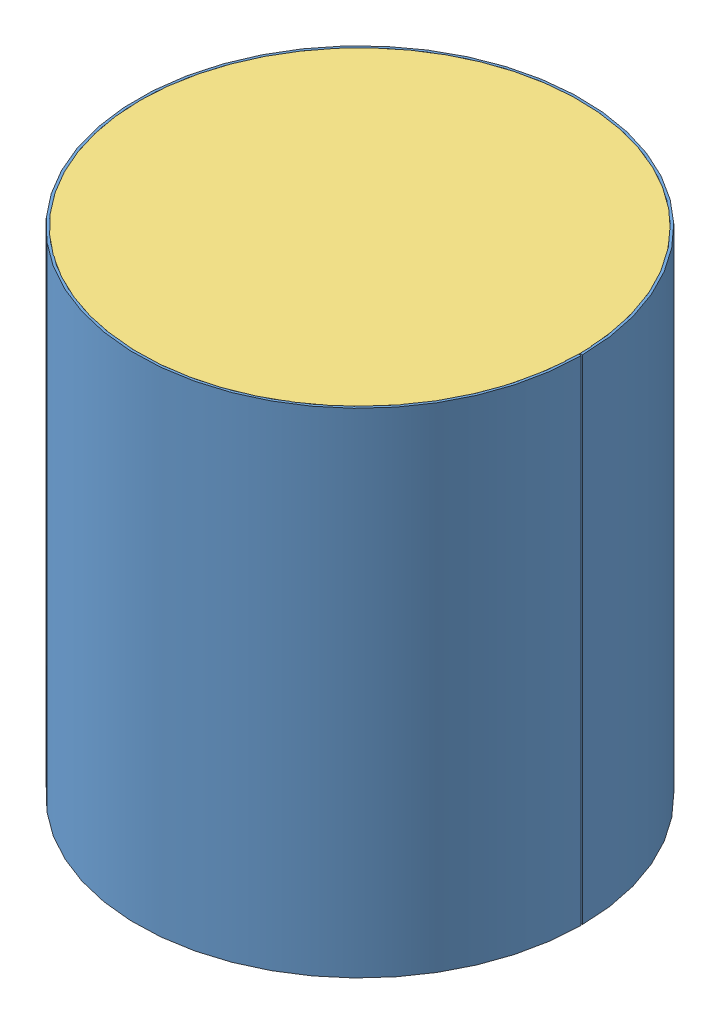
SolidWorks assembly Collecteur modifié.SLDASM, configuration Défaut (file format 12000). Lengths in mm.
Overall size (370 400 360).
3 component instances, 3 part files, 6 mates.
Components (placement in the parent):
- Virole-1: Virole.SLDPRT [Défaut] at (0 -396.9698 0) x (0 0 -1) z (0 1 0) size (360 360 400)
- Piquage taraudé-1: Piquage taraudé.SLDPRT [Défaut] at (-170 -331.9698 0) x (0 0 1) z (-1 0 0) size (50 50 20)
- Fond-1: Fond.SLDPRT [Défaut] at (0 3.0302 0) x (1 0 0) z (0 -1 0) size (356 356 2)
Mates (geometry in assembly coordinates):
- Coïncidente1: coincident anti-aligned: plane of Collecteur-1 through (0 -396.9698 0) normal (0 0 -1)
- Coïncidente2: coincident anti-aligned: plane of Collecteur-1 through (0 -396.9698 0) normal (-1 0 0)
- Coaxiale1: concentric anti-aligned: cylinder of Collecteur-1 through (-271 -331.9698 0) axis (1 0 0) radius 25; circle of Piquage taraudé-1
- Distance2: distance = 190 mm anti-aligned: plane of Piquage taraudé-1 through (-190 -331.9698 0) normal (-1 0 0)
- Coaxiale2: concentric anti-aligned: cylinder of Virole-1 through (0 3.0302 0) axis (0 -1 0) radius 178; cylinder of Fond-1 through (0 1.0302 0) axis (0 1 0) radius 178
- Coïncidente3: coincident aligned: plane of Virole-1 through (0 3.0302 0) normal (0 1 0); plane of Fond-1 through (0 3.0302 0) normal (0 1 0)
